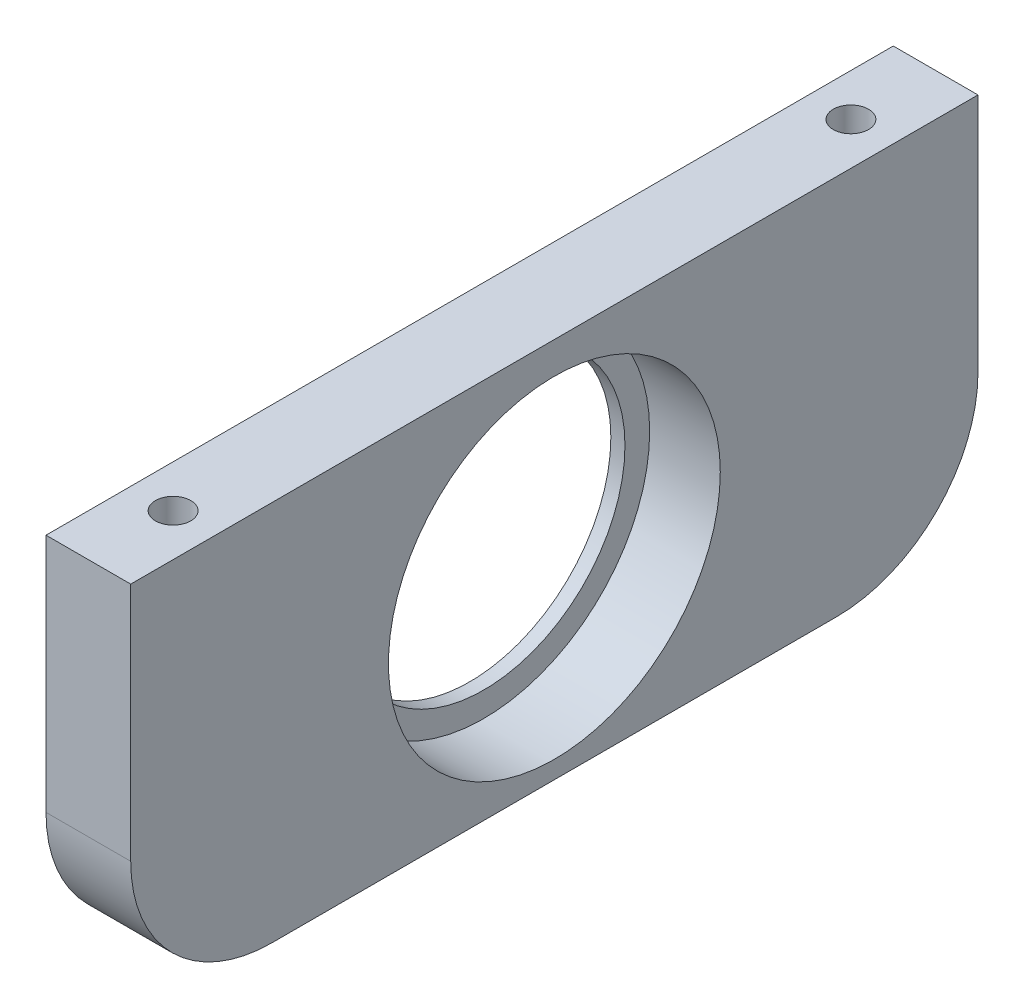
ISO-10303-21;
HEADER;
FILE_DESCRIPTION(('STEP AP214'),'2;1');
FILE_NAME('part.step','',(''),(''),'','','');
FILE_SCHEMA(('AUTOMOTIVE_DESIGN { 1 0 10303 214 1 1 1 1 }'));
ENDSEC;
DATA;
#1=APPLICATION_CONTEXT('core data for automotive mechanical design processes');
#2=APPLICATION_PROTOCOL_DEFINITION('international standard','automotive_design',2000,#1);
#3=PRODUCT_CONTEXT('',#1,'mechanical');
#4=PRODUCT('Part','Part','',(#3));
#5=PRODUCT_RELATED_PRODUCT_CATEGORY('part','',(#4));
#6=PRODUCT_DEFINITION_FORMATION('','',#4);
#7=PRODUCT_DEFINITION_CONTEXT('part definition',#1,'design');
#8=PRODUCT_DEFINITION('design','',#6,#7);
#9=PRODUCT_DEFINITION_SHAPE('','',#8);
#10=(LENGTH_UNIT() NAMED_UNIT(*) SI_UNIT(.MILLI.,.METRE.));
#11=(NAMED_UNIT(*) PLANE_ANGLE_UNIT() SI_UNIT($,.RADIAN.));
#12=(NAMED_UNIT(*) SI_UNIT($,.STERADIAN.) SOLID_ANGLE_UNIT());
#13=UNCERTAINTY_MEASURE_WITH_UNIT(LENGTH_MEASURE(1.E-05),#10,'distance_accuracy_value','');
#14=(GEOMETRIC_REPRESENTATION_CONTEXT(3) GLOBAL_UNCERTAINTY_ASSIGNED_CONTEXT((#13)) GLOBAL_UNIT_ASSIGNED_CONTEXT((#10,
#11,#12)) REPRESENTATION_CONTEXT('',''));
#15=CARTESIAN_POINT('',(0.,0.,0.));
#16=DIRECTION('',(0.,0.,1.));
#17=DIRECTION('',(1.,0.,0.));
#18=AXIS2_PLACEMENT_3D('',#15,#16,#17);
#19=CARTESIAN_POINT('',(6.,-13.,-30.));
#20=DIRECTION('',(0.,0.,1.));
#21=DIRECTION('',(1.,0.,0.));
#22=AXIS2_PLACEMENT_3D('',#19,#20,#21);
#23=PLANE('',#22);
#24=DIRECTION('',(0.,1.,0.));
#25=VECTOR('',#24,1.);
#26=CARTESIAN_POINT('',(6.,-13.,-30.));
#27=LINE('',#26,#25);
#28=CARTESIAN_POINT('',(6.,-2.99999999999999,-30.));
#29=VERTEX_POINT('',#28);
#30=CARTESIAN_POINT('',(6.,14.,-30.));
#31=VERTEX_POINT('',#30);
#32=EDGE_CURVE('E129',#29,#31,#27,.T.);
#33=ORIENTED_EDGE('',*,*,#32,.F.);
#34=DIRECTION('',(-1.,0.,0.));
#35=VECTOR('',#34,1.);
#36=CARTESIAN_POINT('',(6.,-2.99999999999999,-30.));
#37=LINE('',#36,#35);
#38=CARTESIAN_POINT('',(0.,-2.99999999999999,-30.));
#39=VERTEX_POINT('',#38);
#40=EDGE_CURVE('E150',#29,#39,#37,.T.);
#41=ORIENTED_EDGE('',*,*,#40,.T.);
#42=DIRECTION('',(0.,1.,0.));
#43=VECTOR('',#42,1.);
#44=CARTESIAN_POINT('',(0.,-13.,-30.));
#45=LINE('',#44,#43);
#46=CARTESIAN_POINT('',(0.,14.,-30.));
#47=VERTEX_POINT('',#46);
#48=EDGE_CURVE('E126',#39,#47,#45,.T.);
#49=ORIENTED_EDGE('',*,*,#48,.T.);
#50=DIRECTION('',(-1.,0.,0.));
#51=VECTOR('',#50,1.);
#52=CARTESIAN_POINT('',(6.,14.,-30.));
#53=LINE('',#52,#51);
#54=EDGE_CURVE('E147',#31,#47,#53,.T.);
#55=ORIENTED_EDGE('',*,*,#54,.F.);
#56=EDGE_LOOP('',(#33,#41,#49,#55));
#57=FACE_BOUND('',#56,.T.);
#58=ADVANCED_FACE('F36',(#57),#23,.F.);
#59=CARTESIAN_POINT('',(6.,14.,30.));
#60=DIRECTION('',(0.,-1.,0.));
#61=DIRECTION('',(0.,0.,-1.));
#62=AXIS2_PLACEMENT_3D('',#59,#60,#61);
#63=PLANE('',#62);
#64=CARTESIAN_POINT('',(3.,14.,-24.));
#65=DIRECTION('',(0.,1.,0.));
#66=DIRECTION('',(0.,0.,1.));
#67=AXIS2_PLACEMENT_3D('',#64,#65,#66);
#68=CIRCLE('',#67,1.24999999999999);
#69=CARTESIAN_POINT('',(3.,14.,-22.75));
#70=VERTEX_POINT('',#69);
#71=EDGE_CURVE('E106',#70,#70,#68,.T.);
#72=ORIENTED_EDGE('',*,*,#71,.F.);
#73=EDGE_LOOP('',(#72));
#74=FACE_BOUND('',#73,.T.);
#75=CARTESIAN_POINT('',(3.,14.,24.));
#76=DIRECTION('',(0.,1.,0.));
#77=DIRECTION('',(0.,0.,1.));
#78=AXIS2_PLACEMENT_3D('',#75,#76,#77);
#79=CIRCLE('',#78,1.24999999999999);
#80=CARTESIAN_POINT('',(3.,14.,25.25));
#81=VERTEX_POINT('',#80);
#82=EDGE_CURVE('E105',#81,#81,#79,.T.);
#83=ORIENTED_EDGE('',*,*,#82,.F.);
#84=EDGE_LOOP('',(#83));
#85=FACE_BOUND('',#84,.T.);
#86=DIRECTION('',(0.,0.,1.));
#87=VECTOR('',#86,1.);
#88=CARTESIAN_POINT('',(0.,14.,30.));
#89=LINE('',#88,#87);
#90=CARTESIAN_POINT('',(0.,14.,30.));
#91=VERTEX_POINT('',#90);
#92=EDGE_CURVE('E140',#47,#91,#89,.T.);
#93=ORIENTED_EDGE('',*,*,#92,.T.);
#94=DIRECTION('',(-1.,0.,0.));
#95=VECTOR('',#94,1.);
#96=CARTESIAN_POINT('',(6.,14.,30.));
#97=LINE('',#96,#95);
#98=CARTESIAN_POINT('',(6.,14.,30.));
#99=VERTEX_POINT('',#98);
#100=EDGE_CURVE('E138',#99,#91,#97,.T.);
#101=ORIENTED_EDGE('',*,*,#100,.F.);
#102=DIRECTION('',(0.,0.,1.));
#103=VECTOR('',#102,1.);
#104=CARTESIAN_POINT('',(6.,14.,30.));
#105=LINE('',#104,#103);
#106=EDGE_CURVE('E131',#31,#99,#105,.T.);
#107=ORIENTED_EDGE('',*,*,#106,.F.);
#108=ORIENTED_EDGE('',*,*,#54,.T.);
#109=EDGE_LOOP('',(#93,#101,#107,#108));
#110=FACE_BOUND('',#109,.T.);
#111=ADVANCED_FACE('F185',(#74,#85,#110),#63,.F.);
#112=CARTESIAN_POINT('',(6.,-13.,30.));
#113=DIRECTION('',(0.,0.,-1.));
#114=DIRECTION('',(-1.,0.,0.));
#115=AXIS2_PLACEMENT_3D('',#112,#113,#114);
#116=PLANE('',#115);
#117=DIRECTION('',(0.,-1.,0.));
#118=VECTOR('',#117,1.);
#119=CARTESIAN_POINT('',(0.,-13.,30.));
#120=LINE('',#119,#118);
#121=CARTESIAN_POINT('',(0.,-2.99999999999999,30.));
#122=VERTEX_POINT('',#121);
#123=EDGE_CURVE('E142',#91,#122,#120,.T.);
#124=ORIENTED_EDGE('',*,*,#123,.T.);
#125=DIRECTION('',(-1.,0.,0.));
#126=VECTOR('',#125,1.);
#127=CARTESIAN_POINT('',(6.,-2.99999999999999,30.));
#128=LINE('',#127,#126);
#129=CARTESIAN_POINT('',(6.,-2.99999999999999,30.));
#130=VERTEX_POINT('',#129);
#131=EDGE_CURVE('E11',#122,#130,#128,.F.);
#132=ORIENTED_EDGE('',*,*,#131,.T.);
#133=DIRECTION('',(0.,-1.,0.));
#134=VECTOR('',#133,1.);
#135=CARTESIAN_POINT('',(6.,-13.,30.));
#136=LINE('',#135,#134);
#137=EDGE_CURVE('E134',#99,#130,#136,.T.);
#138=ORIENTED_EDGE('',*,*,#137,.F.);
#139=ORIENTED_EDGE('',*,*,#100,.T.);
#140=EDGE_LOOP('',(#124,#132,#138,#139));
#141=FACE_BOUND('',#140,.T.);
#142=ADVANCED_FACE('F182',(#141),#116,.F.);
#143=CARTESIAN_POINT('',(6.,-13.,30.));
#144=DIRECTION('',(0.,1.,0.));
#145=DIRECTION('',(0.,0.,1.));
#146=AXIS2_PLACEMENT_3D('',#143,#144,#145);
#147=PLANE('',#146);
#148=DIRECTION('',(0.,0.,-1.));
#149=VECTOR('',#148,1.);
#150=CARTESIAN_POINT('',(0.,-13.,30.));
#151=LINE('',#150,#149);
#152=CARTESIAN_POINT('',(0.,-13.,20.));
#153=VERTEX_POINT('',#152);
#154=CARTESIAN_POINT('',(0.,-13.,-20.));
#155=VERTEX_POINT('',#154);
#156=EDGE_CURVE('E132',#153,#155,#151,.T.);
#157=ORIENTED_EDGE('',*,*,#156,.T.);
#158=DIRECTION('',(-1.,0.,0.));
#159=VECTOR('',#158,1.);
#160=CARTESIAN_POINT('',(6.,-13.,-20.));
#161=LINE('',#160,#159);
#162=CARTESIAN_POINT('',(6.,-13.,-20.));
#163=VERTEX_POINT('',#162);
#164=EDGE_CURVE('E57',#155,#163,#161,.F.);
#165=ORIENTED_EDGE('',*,*,#164,.T.);
#166=DIRECTION('',(0.,0.,-1.));
#167=VECTOR('',#166,1.);
#168=CARTESIAN_POINT('',(6.,-13.,30.));
#169=LINE('',#168,#167);
#170=CARTESIAN_POINT('',(6.,-13.,20.));
#171=VERTEX_POINT('',#170);
#172=EDGE_CURVE('E136',#171,#163,#169,.T.);
#173=ORIENTED_EDGE('',*,*,#172,.F.);
#174=DIRECTION('',(-1.,0.,0.));
#175=VECTOR('',#174,1.);
#176=CARTESIAN_POINT('',(6.,-13.,20.));
#177=LINE('',#176,#175);
#178=EDGE_CURVE('E157',#171,#153,#177,.T.);
#179=ORIENTED_EDGE('',*,*,#178,.T.);
#180=EDGE_LOOP('',(#157,#165,#173,#179));
#181=FACE_BOUND('',#180,.T.);
#182=ADVANCED_FACE('F177',(#181),#147,.F.);
#183=CARTESIAN_POINT('',(6.,0.,0.));
#184=DIRECTION('',(-1.,0.,0.));
#185=DIRECTION('',(0.,0.,1.));
#186=AXIS2_PLACEMENT_3D('',#183,#184,#185);
#187=PLANE('',#186);
#188=CARTESIAN_POINT('',(6.,0.,0.));
#189=DIRECTION('',(1.,0.,0.));
#190=DIRECTION('',(0.,0.,-1.));
#191=AXIS2_PLACEMENT_3D('',#188,#189,#190);
#192=CIRCLE('',#191,11.75);
#193=CARTESIAN_POINT('',(6.,0.,-11.75));
#194=VERTEX_POINT('',#193);
#195=EDGE_CURVE('E120',#194,#194,#192,.T.);
#196=ORIENTED_EDGE('',*,*,#195,.F.);
#197=EDGE_LOOP('',(#196));
#198=FACE_BOUND('',#197,.T.);
#199=ORIENTED_EDGE('',*,*,#172,.T.);
#200=CARTESIAN_POINT('',(6.,-2.99999999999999,-20.));
#201=DIRECTION('',(-1.,0.,0.));
#202=DIRECTION('',(0.,0.,1.));
#203=AXIS2_PLACEMENT_3D('',#200,#201,#202);
#204=CIRCLE('',#203,10.);
#205=EDGE_CURVE('E44',#163,#29,#204,.F.);
#206=ORIENTED_EDGE('',*,*,#205,.T.);
#207=ORIENTED_EDGE('',*,*,#32,.T.);
#208=ORIENTED_EDGE('',*,*,#106,.T.);
#209=ORIENTED_EDGE('',*,*,#137,.T.);
#210=CARTESIAN_POINT('',(6.,-2.99999999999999,20.));
#211=DIRECTION('',(-1.,0.,0.));
#212=DIRECTION('',(0.,0.,1.));
#213=AXIS2_PLACEMENT_3D('',#210,#211,#212);
#214=CIRCLE('',#213,10.);
#215=EDGE_CURVE('E161',#130,#171,#214,.F.);
#216=ORIENTED_EDGE('',*,*,#215,.T.);
#217=EDGE_LOOP('',(#199,#206,#207,#208,#209,#216));
#218=FACE_BOUND('',#217,.T.);
#219=ADVANCED_FACE('F165',(#198,#218),#187,.F.);
#220=CARTESIAN_POINT('',(0.,0.,0.));
#221=DIRECTION('',(-1.,0.,0.));
#222=DIRECTION('',(0.,0.,1.));
#223=AXIS2_PLACEMENT_3D('',#220,#221,#222);
#224=PLANE('',#223);
#225=CARTESIAN_POINT('',(0.,0.,0.));
#226=DIRECTION('',(1.,0.,0.));
#227=DIRECTION('',(0.,0.,-1.));
#228=AXIS2_PLACEMENT_3D('',#225,#226,#227);
#229=CIRCLE('',#228,10.);
#230=CARTESIAN_POINT('',(0.,0.,-10.));
#231=VERTEX_POINT('',#230);
#232=EDGE_CURVE('E117',#231,#231,#229,.T.);
#233=ORIENTED_EDGE('',*,*,#232,.T.);
#234=EDGE_LOOP('',(#233));
#235=FACE_BOUND('',#234,.T.);
#236=ORIENTED_EDGE('',*,*,#48,.F.);
#237=CARTESIAN_POINT('',(0.,-2.99999999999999,-20.));
#238=DIRECTION('',(-1.,0.,0.));
#239=DIRECTION('',(0.,0.,1.));
#240=AXIS2_PLACEMENT_3D('',#237,#238,#239);
#241=CIRCLE('',#240,10.);
#242=EDGE_CURVE('E155',#39,#155,#241,.T.);
#243=ORIENTED_EDGE('',*,*,#242,.T.);
#244=ORIENTED_EDGE('',*,*,#156,.F.);
#245=CARTESIAN_POINT('',(0.,-2.99999999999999,20.));
#246=DIRECTION('',(-1.,0.,0.));
#247=DIRECTION('',(0.,0.,1.));
#248=AXIS2_PLACEMENT_3D('',#245,#246,#247);
#249=CIRCLE('',#248,10.);
#250=EDGE_CURVE('E153',#153,#122,#249,.T.);
#251=ORIENTED_EDGE('',*,*,#250,.T.);
#252=ORIENTED_EDGE('',*,*,#123,.F.);
#253=ORIENTED_EDGE('',*,*,#92,.F.);
#254=EDGE_LOOP('',(#236,#243,#244,#251,#252,#253));
#255=FACE_BOUND('',#254,.T.);
#256=ADVANCED_FACE('F175',(#235,#255),#224,.T.);
#257=CARTESIAN_POINT('',(1.,0.,0.));
#258=DIRECTION('',(1.,0.,0.));
#259=DIRECTION('',(0.,0.,-1.));
#260=AXIS2_PLACEMENT_3D('',#257,#258,#259);
#261=CYLINDRICAL_SURFACE('',#260,11.75);
#262=CARTESIAN_POINT('',(1.,0.,0.));
#263=DIRECTION('',(1.,0.,0.));
#264=DIRECTION('',(0.,0.,-1.));
#265=AXIS2_PLACEMENT_3D('',#262,#263,#264);
#266=CIRCLE('',#265,11.75);
#267=CARTESIAN_POINT('',(1.,0.,-11.75));
#268=VERTEX_POINT('',#267);
#269=EDGE_CURVE('E123',#268,#268,#266,.T.);
#270=ORIENTED_EDGE('',*,*,#269,.F.);
#271=EDGE_LOOP('',(#270));
#272=FACE_BOUND('',#271,.T.);
#273=ORIENTED_EDGE('',*,*,#195,.T.);
#274=EDGE_LOOP('',(#273));
#275=FACE_BOUND('',#274,.T.);
#276=ADVANCED_FACE('F211',(#272,#275),#261,.F.);
#277=CARTESIAN_POINT('',(1.,0.,0.));
#278=DIRECTION('',(1.,0.,0.));
#279=DIRECTION('',(0.,0.,-1.));
#280=AXIS2_PLACEMENT_3D('',#277,#278,#279);
#281=PLANE('',#280);
#282=CARTESIAN_POINT('',(1.,0.,0.));
#283=DIRECTION('',(1.,0.,0.));
#284=DIRECTION('',(0.,0.,-1.));
#285=AXIS2_PLACEMENT_3D('',#282,#283,#284);
#286=CIRCLE('',#285,10.);
#287=CARTESIAN_POINT('',(1.,0.,-10.));
#288=VERTEX_POINT('',#287);
#289=EDGE_CURVE('E116',#288,#288,#286,.T.);
#290=ORIENTED_EDGE('',*,*,#289,.F.);
#291=EDGE_LOOP('',(#290));
#292=FACE_BOUND('',#291,.T.);
#293=ORIENTED_EDGE('',*,*,#269,.T.);
#294=EDGE_LOOP('',(#293));
#295=FACE_BOUND('',#294,.T.);
#296=ADVANCED_FACE('F205',(#292,#295),#281,.T.);
#297=CARTESIAN_POINT('',(0.,0.,0.));
#298=DIRECTION('',(1.,0.,0.));
#299=DIRECTION('',(0.,0.,-1.));
#300=AXIS2_PLACEMENT_3D('',#297,#298,#299);
#301=CYLINDRICAL_SURFACE('',#300,10.);
#302=ORIENTED_EDGE('',*,*,#232,.F.);
#303=EDGE_LOOP('',(#302));
#304=FACE_BOUND('',#303,.T.);
#305=ORIENTED_EDGE('',*,*,#289,.T.);
#306=EDGE_LOOP('',(#305));
#307=FACE_BOUND('',#306,.T.);
#308=ADVANCED_FACE('F199',(#304,#307),#301,.F.);
#309=CARTESIAN_POINT('',(6.,-2.99999999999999,-20.));
#310=DIRECTION('',(-1.,0.,0.));
#311=DIRECTION('',(0.,0.,1.));
#312=AXIS2_PLACEMENT_3D('',#309,#310,#311);
#313=CYLINDRICAL_SURFACE('',#312,10.);
#314=ORIENTED_EDGE('',*,*,#205,.F.);
#315=ORIENTED_EDGE('',*,*,#164,.F.);
#316=ORIENTED_EDGE('',*,*,#242,.F.);
#317=ORIENTED_EDGE('',*,*,#40,.F.);
#318=EDGE_LOOP('',(#314,#315,#316,#317));
#319=FACE_BOUND('',#318,.T.);
#320=ADVANCED_FACE('F172',(#319),#313,.T.);
#321=CARTESIAN_POINT('',(6.,-2.99999999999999,20.));
#322=DIRECTION('',(-1.,0.,0.));
#323=DIRECTION('',(0.,0.,1.));
#324=AXIS2_PLACEMENT_3D('',#321,#322,#323);
#325=CYLINDRICAL_SURFACE('',#324,10.);
#326=ORIENTED_EDGE('',*,*,#215,.F.);
#327=ORIENTED_EDGE('',*,*,#131,.F.);
#328=ORIENTED_EDGE('',*,*,#250,.F.);
#329=ORIENTED_EDGE('',*,*,#178,.F.);
#330=EDGE_LOOP('',(#326,#327,#328,#329));
#331=FACE_BOUND('',#330,.T.);
#332=ADVANCED_FACE('F38',(#331),#325,.T.);
#333=CARTESIAN_POINT('',(3.,6.5,24.));
#334=DIRECTION('',(0.,1.,0.));
#335=DIRECTION('',(0.,0.,1.));
#336=AXIS2_PLACEMENT_3D('',#333,#334,#335);
#337=CONICAL_SURFACE('',#336,1.24999999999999,1.02974425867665);
#338=CARTESIAN_POINT('',(3.,5.74892422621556,24.));
#339=VERTEX_POINT('',#338);
#340=VERTEX_LOOP('',#339);
#341=FACE_BOUND('',#340,.T.);
#342=CARTESIAN_POINT('',(3.,6.5,24.));
#343=DIRECTION('',(0.,1.,0.));
#344=DIRECTION('',(0.,0.,1.));
#345=AXIS2_PLACEMENT_3D('',#342,#343,#344);
#346=CIRCLE('',#345,1.24999999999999);
#347=CARTESIAN_POINT('',(3.,6.5,25.25));
#348=VERTEX_POINT('',#347);
#349=EDGE_CURVE('E109',#348,#348,#346,.T.);
#350=ORIENTED_EDGE('',*,*,#349,.T.);
#351=EDGE_LOOP('',(#350));
#352=FACE_BOUND('',#351,.T.);
#353=ADVANCED_FACE('F204',(#341,#352),#337,.F.);
#354=CARTESIAN_POINT('',(3.,14.,24.));
#355=DIRECTION('',(0.,1.,0.));
#356=DIRECTION('',(0.,0.,1.));
#357=AXIS2_PLACEMENT_3D('',#354,#355,#356);
#358=CYLINDRICAL_SURFACE('',#357,1.24999999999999);
#359=ORIENTED_EDGE('',*,*,#349,.F.);
#360=EDGE_LOOP('',(#359));
#361=FACE_BOUND('',#360,.T.);
#362=ORIENTED_EDGE('',*,*,#82,.T.);
#363=EDGE_LOOP('',(#362));
#364=FACE_BOUND('',#363,.T.);
#365=ADVANCED_FACE('F99',(#361,#364),#358,.F.);
#366=CARTESIAN_POINT('',(3.,6.5,-24.));
#367=DIRECTION('',(0.,1.,0.));
#368=DIRECTION('',(0.,0.,1.));
#369=AXIS2_PLACEMENT_3D('',#366,#367,#368);
#370=CONICAL_SURFACE('',#369,1.24999999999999,1.02974425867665);
#371=CARTESIAN_POINT('',(3.,5.74892422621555,-24.));
#372=VERTEX_POINT('',#371);
#373=VERTEX_LOOP('',#372);
#374=FACE_BOUND('',#373,.T.);
#375=CARTESIAN_POINT('',(3.,6.5,-24.));
#376=DIRECTION('',(0.,1.,0.));
#377=DIRECTION('',(0.,0.,1.));
#378=AXIS2_PLACEMENT_3D('',#375,#376,#377);
#379=CIRCLE('',#378,1.24999999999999);
#380=CARTESIAN_POINT('',(3.,6.5,-22.75));
#381=VERTEX_POINT('',#380);
#382=EDGE_CURVE('E103',#381,#381,#379,.T.);
#383=ORIENTED_EDGE('',*,*,#382,.T.);
#384=EDGE_LOOP('',(#383));
#385=FACE_BOUND('',#384,.T.);
#386=ADVANCED_FACE('F95',(#374,#385),#370,.F.);
#387=CARTESIAN_POINT('',(3.,14.,-24.));
#388=DIRECTION('',(0.,1.,0.));
#389=DIRECTION('',(0.,0.,1.));
#390=AXIS2_PLACEMENT_3D('',#387,#388,#389);
#391=CYLINDRICAL_SURFACE('',#390,1.24999999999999);
#392=ORIENTED_EDGE('',*,*,#382,.F.);
#393=EDGE_LOOP('',(#392));
#394=FACE_BOUND('',#393,.T.);
#395=ORIENTED_EDGE('',*,*,#71,.T.);
#396=EDGE_LOOP('',(#395));
#397=FACE_BOUND('',#396,.T.);
#398=ADVANCED_FACE('F98',(#394,#397),#391,.F.);
#399=CLOSED_SHELL('',(#58,#111,#142,#182,#219,#256,#276,#296,#308,#320,#332,#353,#365,#386,#398));
#400=MANIFOLD_SOLID_BREP('B2',#399);
#401=ADVANCED_BREP_SHAPE_REPRESENTATION('',(#18,#400),#14);
#402=SHAPE_DEFINITION_REPRESENTATION(#9,#401);
ENDSEC;
END-ISO-10303-21;
